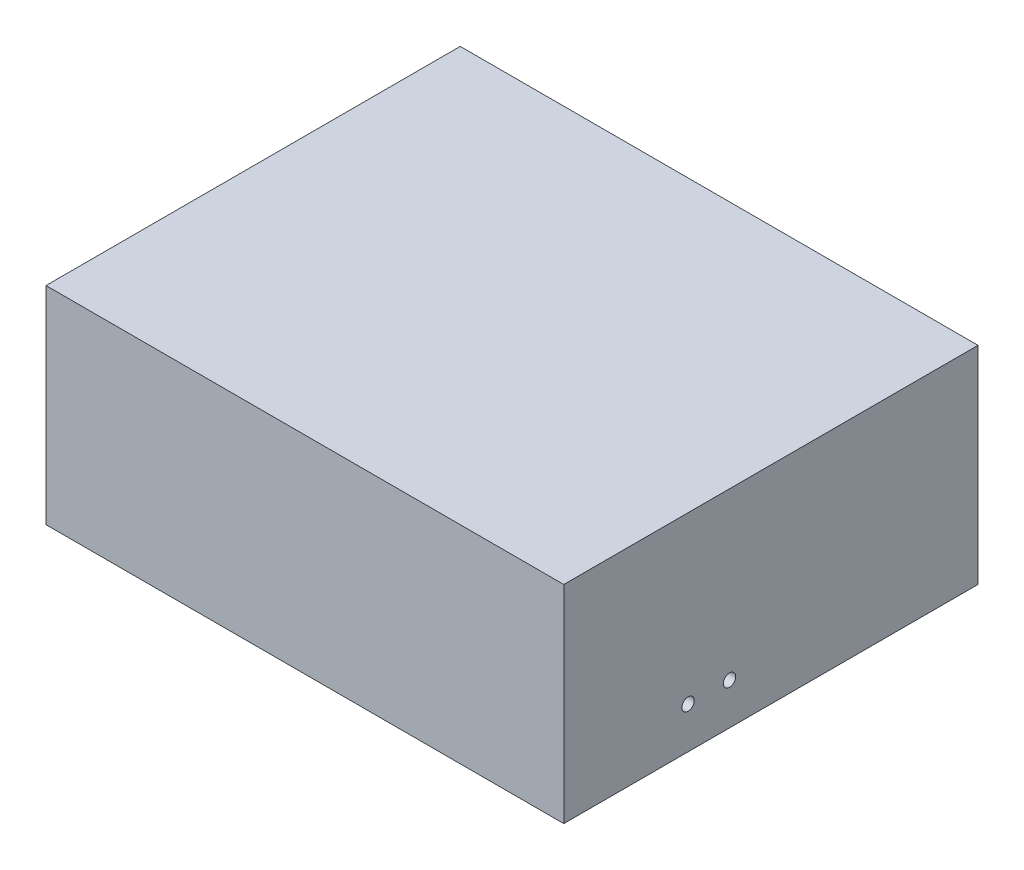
from build123d import *

# Parameters (mm, degrees)
SKETCH2_W           = 250
SKETCH2_H           = 200
BOSS_EXTRUDE1_DEPTH = 100
SKETCH4_R           = 5
CUT_EXTRUDE1_DEPTH  = 5
SKETCH3_R           = 3
CUT_EXTRUDE2_DEPTH  = 10


with BuildPart() as part:
    # Sketch2 → Boss-Extrude1 (new body)
    with BuildSketch(Plane(origin=(0, 0, 0), x_dir=(1, 0, 0), z_dir=(0, 1, 0))):
        Rectangle(SKETCH2_W, SKETCH2_H)
    extrude(amount=BOSS_EXTRUDE1_DEPTH)

    # Sketch4 → Cut-Extrude1 (cut)
    with BuildSketch(Plane.XZ):
        with Locations(Location((-105, 80, 0), (0, 0, 270))):
            Circle(SKETCH4_R)
        with Locations(Location((105, 80, 0), (0, 0, 270))):
            Circle(SKETCH4_R)
        with Locations(Location((-105, -80, 0), (0, 0, 270))):
            Circle(SKETCH4_R)
        with Locations(Location((105, -80, 0), (0, 0, 270))):
            Circle(SKETCH4_R)
    extrude(amount=-CUT_EXTRUDE1_DEPTH, mode=Mode.SUBTRACT)

    # Sketch3 → Cut-Extrude2 (cut)
    with BuildSketch(Plane(origin=(125, 0, 0), x_dir=(0, 0, -1), z_dir=(1, 0, 0))):
        with Locations((-40, 20)):
            Circle(SKETCH3_R)
        with Locations((-20, 20)):
            Circle(SKETCH3_R)
    extrude(amount=-CUT_EXTRUDE2_DEPTH, mode=Mode.SUBTRACT)


solid = part.part
